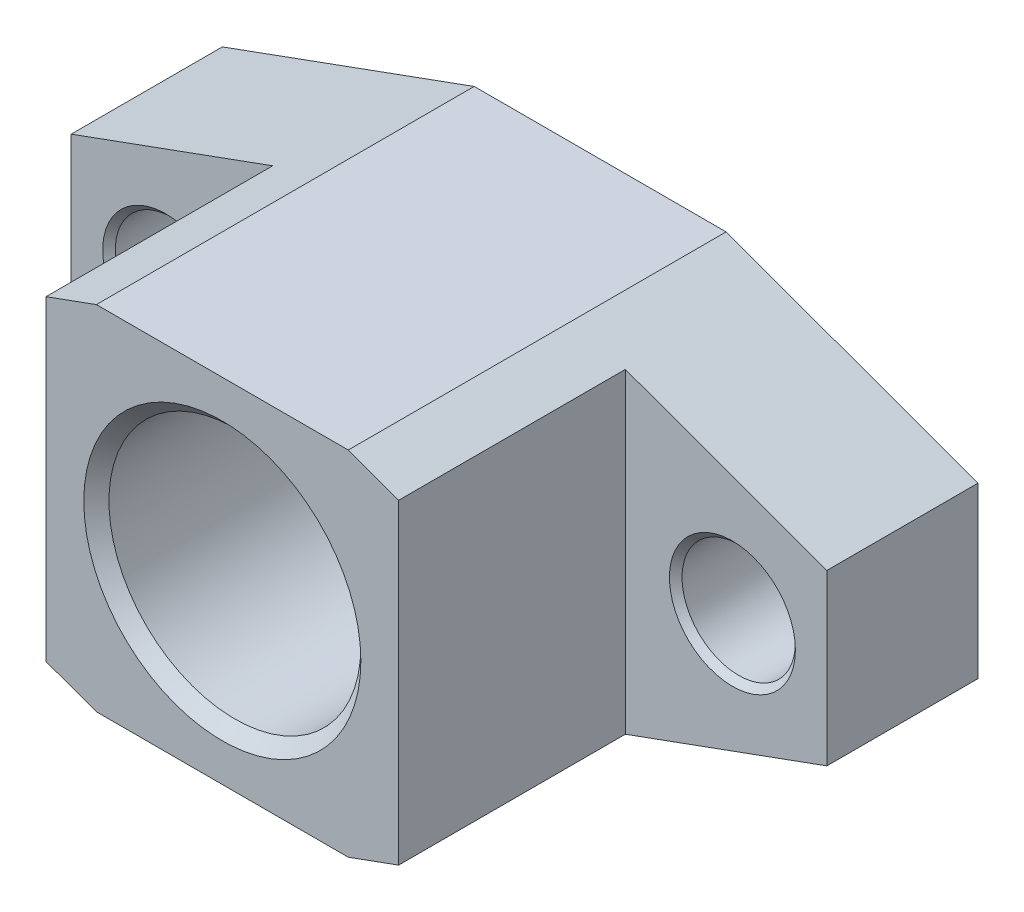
ISO-10303-21;
HEADER;
FILE_DESCRIPTION(('STEP AP214'),'2;1');
FILE_NAME('part.step','',(''),(''),'','','');
FILE_SCHEMA(('AUTOMOTIVE_DESIGN { 1 0 10303 214 1 1 1 1 }'));
ENDSEC;
DATA;
#1=APPLICATION_CONTEXT('core data for automotive mechanical design processes');
#2=APPLICATION_PROTOCOL_DEFINITION('international standard','automotive_design',2000,#1);
#3=PRODUCT_CONTEXT('',#1,'mechanical');
#4=PRODUCT('Part','Part','',(#3));
#5=PRODUCT_RELATED_PRODUCT_CATEGORY('part','',(#4));
#6=PRODUCT_DEFINITION_FORMATION('','',#4);
#7=PRODUCT_DEFINITION_CONTEXT('part definition',#1,'design');
#8=PRODUCT_DEFINITION('design','',#6,#7);
#9=PRODUCT_DEFINITION_SHAPE('','',#8);
#10=(LENGTH_UNIT() NAMED_UNIT(*) SI_UNIT(.MILLI.,.METRE.));
#11=(NAMED_UNIT(*) PLANE_ANGLE_UNIT() SI_UNIT($,.RADIAN.));
#12=(NAMED_UNIT(*) SI_UNIT($,.STERADIAN.) SOLID_ANGLE_UNIT());
#13=UNCERTAINTY_MEASURE_WITH_UNIT(LENGTH_MEASURE(1.E-05),#10,'distance_accuracy_value','');
#14=(GEOMETRIC_REPRESENTATION_CONTEXT(3) GLOBAL_UNCERTAINTY_ASSIGNED_CONTEXT((#13)) GLOBAL_UNIT_ASSIGNED_CONTEXT((#10,
#11,#12)) REPRESENTATION_CONTEXT('',''));
#15=CARTESIAN_POINT('',(0.,0.,0.));
#16=DIRECTION('',(0.,0.,1.));
#17=DIRECTION('',(1.,0.,0.));
#18=AXIS2_PLACEMENT_3D('',#15,#16,#17);
#19=CARTESIAN_POINT('',(-30.,6.72059531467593,12.));
#20=DIRECTION('',(0.,0.,1.));
#21=DIRECTION('',(1.,0.,0.));
#22=AXIS2_PLACEMENT_3D('',#19,#20,#21);
#23=PLANE('',#22);
#24=CARTESIAN_POINT('',(22.5,0.,12.));
#25=DIRECTION('',(0.,0.,1.));
#26=DIRECTION('',(1.,0.,0.));
#27=AXIS2_PLACEMENT_3D('',#24,#25,#26);
#28=CIRCLE('',#27,5.);
#29=CARTESIAN_POINT('',(27.5,0.,12.));
#30=VERTEX_POINT('',#29);
#31=EDGE_CURVE('E486',#30,#30,#28,.T.);
#32=ORIENTED_EDGE('',*,*,#31,.F.);
#33=EDGE_LOOP('',(#32));
#34=FACE_BOUND('',#33,.T.);
#35=DIRECTION('',(0.,1.,0.));
#36=VECTOR('',#35,1.);
#37=CARTESIAN_POINT('',(14.,12.5441190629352,12.));
#38=LINE('',#37,#36);
#39=CARTESIAN_POINT('',(14.,-12.5441190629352,12.));
#40=VERTEX_POINT('',#39);
#41=CARTESIAN_POINT('',(14.,12.5441190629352,12.));
#42=VERTEX_POINT('',#41);
#43=EDGE_CURVE('E35',#40,#42,#38,.T.);
#44=ORIENTED_EDGE('',*,*,#43,.F.);
#45=DIRECTION('',(0.939692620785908,0.342020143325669,0.));
#46=VECTOR('',#45,1.);
#47=CARTESIAN_POINT('',(10.,-14.,12.));
#48=LINE('',#47,#46);
#49=CARTESIAN_POINT('',(30.,-6.72059531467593,12.));
#50=VERTEX_POINT('',#49);
#51=EDGE_CURVE('E161',#40,#50,#48,.T.);
#52=ORIENTED_EDGE('',*,*,#51,.T.);
#53=DIRECTION('',(0.,1.,0.));
#54=VECTOR('',#53,1.);
#55=CARTESIAN_POINT('',(30.,6.72059531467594,12.));
#56=LINE('',#55,#54);
#57=CARTESIAN_POINT('',(30.,6.72059531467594,12.));
#58=VERTEX_POINT('',#57);
#59=EDGE_CURVE('E167',#50,#58,#56,.T.);
#60=ORIENTED_EDGE('',*,*,#59,.T.);
#61=DIRECTION('',(-0.939692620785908,0.342020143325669,0.));
#62=VECTOR('',#61,1.);
#63=CARTESIAN_POINT('',(10.,14.,12.));
#64=LINE('',#63,#62);
#65=EDGE_CURVE('E31',#58,#42,#64,.T.);
#66=ORIENTED_EDGE('',*,*,#65,.T.);
#67=EDGE_LOOP('',(#44,#52,#60,#66));
#68=FACE_BOUND('',#67,.T.);
#69=ADVANCED_FACE('F14',(#34,#68),#23,.T.);
#70=CARTESIAN_POINT('',(-10.,14.,12.));
#71=DIRECTION('',(0.342020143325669,-0.939692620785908,0.));
#72=DIRECTION('',(0.939692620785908,0.342020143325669,0.));
#73=AXIS2_PLACEMENT_3D('',#70,#71,#72);
#74=PLANE('',#73);
#75=DIRECTION('',(-0.939692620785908,-0.342020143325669,0.));
#76=VECTOR('',#75,1.);
#77=CARTESIAN_POINT('',(-10.,14.,0.));
#78=LINE('',#77,#76);
#79=CARTESIAN_POINT('',(-10.,14.,0.));
#80=VERTEX_POINT('',#79);
#81=CARTESIAN_POINT('',(-30.,6.72059531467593,0.));
#82=VERTEX_POINT('',#81);
#83=EDGE_CURVE('E130',#80,#82,#78,.T.);
#84=ORIENTED_EDGE('',*,*,#83,.T.);
#85=DIRECTION('',(0.,0.,-1.));
#86=VECTOR('',#85,1.);
#87=CARTESIAN_POINT('',(-30.,6.72059531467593,12.));
#88=LINE('',#87,#86);
#89=CARTESIAN_POINT('',(-30.,6.72059531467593,12.));
#90=VERTEX_POINT('',#89);
#91=EDGE_CURVE('E9',#90,#82,#88,.T.);
#92=ORIENTED_EDGE('',*,*,#91,.F.);
#93=DIRECTION('',(-0.939692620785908,-0.342020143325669,0.));
#94=VECTOR('',#93,1.);
#95=CARTESIAN_POINT('',(-10.,14.,12.));
#96=LINE('',#95,#94);
#97=CARTESIAN_POINT('',(-14.,12.5441190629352,12.));
#98=VERTEX_POINT('',#97);
#99=EDGE_CURVE('E129',#98,#90,#96,.T.);
#100=ORIENTED_EDGE('',*,*,#99,.F.);
#101=DIRECTION('',(0.,0.,-1.));
#102=VECTOR('',#101,1.);
#103=CARTESIAN_POINT('',(-14.,12.5441190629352,30.));
#104=LINE('',#103,#102);
#105=CARTESIAN_POINT('',(-14.,12.5441190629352,30.));
#106=VERTEX_POINT('',#105);
#107=EDGE_CURVE('E108',#106,#98,#104,.T.);
#108=ORIENTED_EDGE('',*,*,#107,.F.);
#109=DIRECTION('',(-0.939692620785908,-0.342020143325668,0.));
#110=VECTOR('',#109,1.);
#111=CARTESIAN_POINT('',(-10.,14.,30.));
#112=LINE('',#111,#110);
#113=CARTESIAN_POINT('',(-10.,14.,30.));
#114=VERTEX_POINT('',#113);
#115=EDGE_CURVE('E115',#114,#106,#112,.T.);
#116=ORIENTED_EDGE('',*,*,#115,.F.);
#117=DIRECTION('',(0.,0.,-1.));
#118=VECTOR('',#117,1.);
#119=CARTESIAN_POINT('',(-10.,14.,12.));
#120=LINE('',#119,#118);
#121=EDGE_CURVE('E172',#114,#80,#120,.T.);
#122=ORIENTED_EDGE('',*,*,#121,.T.);
#123=EDGE_LOOP('',(#84,#92,#100,#108,#116,#122));
#124=FACE_BOUND('',#123,.T.);
#125=ADVANCED_FACE('F16',(#124),#74,.F.);
#126=CARTESIAN_POINT('',(-30.,6.72059531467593,12.));
#127=DIRECTION('',(1.,0.,0.));
#128=DIRECTION('',(0.,0.,-1.));
#129=AXIS2_PLACEMENT_3D('',#126,#127,#128);
#130=PLANE('',#129);
#131=DIRECTION('',(0.,-1.,0.));
#132=VECTOR('',#131,1.);
#133=CARTESIAN_POINT('',(-30.,6.72059531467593,0.));
#134=LINE('',#133,#132);
#135=CARTESIAN_POINT('',(-30.,-6.72059531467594,0.));
#136=VERTEX_POINT('',#135);
#137=EDGE_CURVE('E132',#82,#136,#134,.T.);
#138=ORIENTED_EDGE('',*,*,#137,.T.);
#139=DIRECTION('',(0.,0.,-1.));
#140=VECTOR('',#139,1.);
#141=CARTESIAN_POINT('',(-30.,-6.72059531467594,12.));
#142=LINE('',#141,#140);
#143=CARTESIAN_POINT('',(-30.,-6.72059531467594,12.));
#144=VERTEX_POINT('',#143);
#145=EDGE_CURVE('E23',#144,#136,#142,.T.);
#146=ORIENTED_EDGE('',*,*,#145,.F.);
#147=DIRECTION('',(0.,-1.,0.));
#148=VECTOR('',#147,1.);
#149=CARTESIAN_POINT('',(-30.,6.72059531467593,12.));
#150=LINE('',#149,#148);
#151=EDGE_CURVE('E153',#90,#144,#150,.T.);
#152=ORIENTED_EDGE('',*,*,#151,.F.);
#153=ORIENTED_EDGE('',*,*,#91,.T.);
#154=EDGE_LOOP('',(#138,#146,#152,#153));
#155=FACE_BOUND('',#154,.T.);
#156=ADVANCED_FACE('F244',(#155),#130,.F.);
#157=CARTESIAN_POINT('',(-10.,-14.,12.));
#158=DIRECTION('',(0.342020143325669,0.939692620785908,0.));
#159=DIRECTION('',(-0.939692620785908,0.342020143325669,0.));
#160=AXIS2_PLACEMENT_3D('',#157,#158,#159);
#161=PLANE('',#160);
#162=DIRECTION('',(0.939692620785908,-0.342020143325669,0.));
#163=VECTOR('',#162,1.);
#164=CARTESIAN_POINT('',(-10.,-14.,0.));
#165=LINE('',#164,#163);
#166=CARTESIAN_POINT('',(-10.,-14.,0.));
#167=VERTEX_POINT('',#166);
#168=EDGE_CURVE('E288',#136,#167,#165,.T.);
#169=ORIENTED_EDGE('',*,*,#168,.T.);
#170=DIRECTION('',(0.,0.,-1.));
#171=VECTOR('',#170,1.);
#172=CARTESIAN_POINT('',(-10.,-14.,12.));
#173=LINE('',#172,#171);
#174=CARTESIAN_POINT('',(-10.,-14.,30.));
#175=VERTEX_POINT('',#174);
#176=EDGE_CURVE('E268',#175,#167,#173,.T.);
#177=ORIENTED_EDGE('',*,*,#176,.F.);
#178=DIRECTION('',(0.939692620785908,-0.34202014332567,0.));
#179=VECTOR('',#178,1.);
#180=CARTESIAN_POINT('',(-14.,-12.5441190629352,30.));
#181=LINE('',#180,#179);
#182=CARTESIAN_POINT('',(-14.,-12.5441190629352,30.));
#183=VERTEX_POINT('',#182);
#184=EDGE_CURVE('E114',#183,#175,#181,.T.);
#185=ORIENTED_EDGE('',*,*,#184,.F.);
#186=DIRECTION('',(0.,0.,-1.));
#187=VECTOR('',#186,1.);
#188=CARTESIAN_POINT('',(-14.,-12.5441190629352,30.));
#189=LINE('',#188,#187);
#190=CARTESIAN_POINT('',(-14.,-12.5441190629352,12.));
#191=VERTEX_POINT('',#190);
#192=EDGE_CURVE('E110',#183,#191,#189,.T.);
#193=ORIENTED_EDGE('',*,*,#192,.T.);
#194=DIRECTION('',(0.939692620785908,-0.342020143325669,0.));
#195=VECTOR('',#194,1.);
#196=CARTESIAN_POINT('',(-10.,-14.,12.));
#197=LINE('',#196,#195);
#198=EDGE_CURVE('E159',#144,#191,#197,.T.);
#199=ORIENTED_EDGE('',*,*,#198,.F.);
#200=ORIENTED_EDGE('',*,*,#145,.T.);
#201=EDGE_LOOP('',(#169,#177,#185,#193,#199,#200));
#202=FACE_BOUND('',#201,.T.);
#203=ADVANCED_FACE('F265',(#202),#161,.F.);
#204=CARTESIAN_POINT('',(10.,-14.,12.));
#205=DIRECTION('',(0.,1.,0.));
#206=DIRECTION('',(-1.,0.,0.));
#207=AXIS2_PLACEMENT_3D('',#204,#205,#206);
#208=PLANE('',#207);
#209=DIRECTION('',(1.,0.,0.));
#210=VECTOR('',#209,1.);
#211=CARTESIAN_POINT('',(10.,-14.,0.));
#212=LINE('',#211,#210);
#213=CARTESIAN_POINT('',(10.,-14.,0.));
#214=VERTEX_POINT('',#213);
#215=EDGE_CURVE('E274',#167,#214,#212,.T.);
#216=ORIENTED_EDGE('',*,*,#215,.T.);
#217=DIRECTION('',(0.,0.,-1.));
#218=VECTOR('',#217,1.);
#219=CARTESIAN_POINT('',(10.,-14.,12.));
#220=LINE('',#219,#218);
#221=CARTESIAN_POINT('',(10.,-14.,30.));
#222=VERTEX_POINT('',#221);
#223=EDGE_CURVE('E273',#222,#214,#220,.T.);
#224=ORIENTED_EDGE('',*,*,#223,.F.);
#225=DIRECTION('',(1.,0.,0.));
#226=VECTOR('',#225,1.);
#227=CARTESIAN_POINT('',(-10.,-14.,30.));
#228=LINE('',#227,#226);
#229=EDGE_CURVE('E185',#175,#222,#228,.T.);
#230=ORIENTED_EDGE('',*,*,#229,.F.);
#231=ORIENTED_EDGE('',*,*,#176,.T.);
#232=EDGE_LOOP('',(#216,#224,#230,#231));
#233=FACE_BOUND('',#232,.T.);
#234=ADVANCED_FACE('F271',(#233),#208,.F.);
#235=CARTESIAN_POINT('',(10.,-14.,12.));
#236=DIRECTION('',(-0.342020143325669,0.939692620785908,0.));
#237=DIRECTION('',(-0.939692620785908,-0.342020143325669,0.));
#238=AXIS2_PLACEMENT_3D('',#235,#236,#237);
#239=PLANE('',#238);
#240=DIRECTION('',(0.939692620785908,0.342020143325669,0.));
#241=VECTOR('',#240,1.);
#242=CARTESIAN_POINT('',(10.,-14.,0.));
#243=LINE('',#242,#241);
#244=CARTESIAN_POINT('',(30.,-6.72059531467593,0.));
#245=VERTEX_POINT('',#244);
#246=EDGE_CURVE('E285',#214,#245,#243,.T.);
#247=ORIENTED_EDGE('',*,*,#246,.T.);
#248=DIRECTION('',(0.,0.,-1.));
#249=VECTOR('',#248,1.);
#250=CARTESIAN_POINT('',(30.,-6.72059531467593,12.));
#251=LINE('',#250,#249);
#252=EDGE_CURVE('E209',#50,#245,#251,.T.);
#253=ORIENTED_EDGE('',*,*,#252,.F.);
#254=ORIENTED_EDGE('',*,*,#51,.F.);
#255=DIRECTION('',(0.,0.,-1.));
#256=VECTOR('',#255,1.);
#257=CARTESIAN_POINT('',(14.,-12.5441190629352,30.));
#258=LINE('',#257,#256);
#259=CARTESIAN_POINT('',(14.,-12.5441190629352,30.));
#260=VERTEX_POINT('',#259);
#261=EDGE_CURVE('E134',#260,#40,#258,.T.);
#262=ORIENTED_EDGE('',*,*,#261,.F.);
#263=DIRECTION('',(0.939692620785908,0.34202014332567,0.));
#264=VECTOR('',#263,1.);
#265=CARTESIAN_POINT('',(10.,-14.,30.));
#266=LINE('',#265,#264);
#267=EDGE_CURVE('E188',#222,#260,#266,.T.);
#268=ORIENTED_EDGE('',*,*,#267,.F.);
#269=ORIENTED_EDGE('',*,*,#223,.T.);
#270=EDGE_LOOP('',(#247,#253,#254,#262,#268,#269));
#271=FACE_BOUND('',#270,.T.);
#272=ADVANCED_FACE('F205',(#271),#239,.F.);
#273=CARTESIAN_POINT('',(30.,6.72059531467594,12.));
#274=DIRECTION('',(-1.,0.,0.));
#275=DIRECTION('',(0.,0.,1.));
#276=AXIS2_PLACEMENT_3D('',#273,#274,#275);
#277=PLANE('',#276);
#278=DIRECTION('',(0.,1.,0.));
#279=VECTOR('',#278,1.);
#280=CARTESIAN_POINT('',(30.,6.72059531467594,0.));
#281=LINE('',#280,#279);
#282=CARTESIAN_POINT('',(30.,6.72059531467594,0.));
#283=VERTEX_POINT('',#282);
#284=EDGE_CURVE('E217',#245,#283,#281,.T.);
#285=ORIENTED_EDGE('',*,*,#284,.T.);
#286=DIRECTION('',(0.,0.,-1.));
#287=VECTOR('',#286,1.);
#288=CARTESIAN_POINT('',(30.,6.72059531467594,12.));
#289=LINE('',#288,#287);
#290=EDGE_CURVE('E214',#58,#283,#289,.T.);
#291=ORIENTED_EDGE('',*,*,#290,.F.);
#292=ORIENTED_EDGE('',*,*,#59,.F.);
#293=ORIENTED_EDGE('',*,*,#252,.T.);
#294=EDGE_LOOP('',(#285,#291,#292,#293));
#295=FACE_BOUND('',#294,.T.);
#296=ADVANCED_FACE('F215',(#295),#277,.F.);
#297=CARTESIAN_POINT('',(10.,14.,12.));
#298=DIRECTION('',(-0.342020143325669,-0.939692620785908,0.));
#299=DIRECTION('',(0.939692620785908,-0.342020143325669,0.));
#300=AXIS2_PLACEMENT_3D('',#297,#298,#299);
#301=PLANE('',#300);
#302=DIRECTION('',(-0.939692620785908,0.342020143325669,0.));
#303=VECTOR('',#302,1.);
#304=CARTESIAN_POINT('',(10.,14.,0.));
#305=LINE('',#304,#303);
#306=CARTESIAN_POINT('',(10.,14.,0.));
#307=VERTEX_POINT('',#306);
#308=EDGE_CURVE('E222',#283,#307,#305,.T.);
#309=ORIENTED_EDGE('',*,*,#308,.T.);
#310=DIRECTION('',(0.,0.,-1.));
#311=VECTOR('',#310,1.);
#312=CARTESIAN_POINT('',(10.,14.,12.));
#313=LINE('',#312,#311);
#314=CARTESIAN_POINT('',(10.,14.,30.));
#315=VERTEX_POINT('',#314);
#316=EDGE_CURVE('E219',#315,#307,#313,.T.);
#317=ORIENTED_EDGE('',*,*,#316,.F.);
#318=DIRECTION('',(-0.939692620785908,0.34202014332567,0.));
#319=VECTOR('',#318,1.);
#320=CARTESIAN_POINT('',(14.,12.5441190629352,30.));
#321=LINE('',#320,#319);
#322=CARTESIAN_POINT('',(14.,12.5441190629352,30.));
#323=VERTEX_POINT('',#322);
#324=EDGE_CURVE('E192',#323,#315,#321,.T.);
#325=ORIENTED_EDGE('',*,*,#324,.F.);
#326=DIRECTION('',(0.,0.,-1.));
#327=VECTOR('',#326,1.);
#328=CARTESIAN_POINT('',(14.,12.5441190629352,30.));
#329=LINE('',#328,#327);
#330=EDGE_CURVE('E144',#323,#42,#329,.T.);
#331=ORIENTED_EDGE('',*,*,#330,.T.);
#332=ORIENTED_EDGE('',*,*,#65,.F.);
#333=ORIENTED_EDGE('',*,*,#290,.T.);
#334=EDGE_LOOP('',(#309,#317,#325,#331,#332,#333));
#335=FACE_BOUND('',#334,.T.);
#336=ADVANCED_FACE('F221',(#335),#301,.F.);
#337=CARTESIAN_POINT('',(10.,14.,12.));
#338=DIRECTION('',(0.,-1.,0.));
#339=DIRECTION('',(1.,0.,0.));
#340=AXIS2_PLACEMENT_3D('',#337,#338,#339);
#341=PLANE('',#340);
#342=DIRECTION('',(-1.,0.,0.));
#343=VECTOR('',#342,1.);
#344=CARTESIAN_POINT('',(10.,14.,0.));
#345=LINE('',#344,#343);
#346=EDGE_CURVE('E157',#307,#80,#345,.T.);
#347=ORIENTED_EDGE('',*,*,#346,.T.);
#348=ORIENTED_EDGE('',*,*,#121,.F.);
#349=DIRECTION('',(-1.,0.,0.));
#350=VECTOR('',#349,1.);
#351=CARTESIAN_POINT('',(10.,14.,30.));
#352=LINE('',#351,#350);
#353=EDGE_CURVE('E122',#315,#114,#352,.T.);
#354=ORIENTED_EDGE('',*,*,#353,.F.);
#355=ORIENTED_EDGE('',*,*,#316,.T.);
#356=EDGE_LOOP('',(#347,#348,#354,#355));
#357=FACE_BOUND('',#356,.T.);
#358=ADVANCED_FACE('F225',(#357),#341,.F.);
#359=CARTESIAN_POINT('',(-22.5,0.,12.));
#360=DIRECTION('',(0.,0.,1.));
#361=DIRECTION('',(1.,0.,0.));
#362=AXIS2_PLACEMENT_3D('',#359,#360,#361);
#363=CIRCLE('',#362,5.);
#364=CARTESIAN_POINT('',(-17.5,0.,12.));
#365=VERTEX_POINT('',#364);
#366=EDGE_CURVE('E259',#365,#365,#363,.T.);
#367=ORIENTED_EDGE('',*,*,#366,.F.);
#368=EDGE_LOOP('',(#367));
#369=FACE_BOUND('',#368,.T.);
#370=DIRECTION('',(0.,-1.,0.));
#371=VECTOR('',#370,1.);
#372=CARTESIAN_POINT('',(-14.,12.5441190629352,12.));
#373=LINE('',#372,#371);
#374=EDGE_CURVE('E143',#98,#191,#373,.T.);
#375=ORIENTED_EDGE('',*,*,#374,.F.);
#376=ORIENTED_EDGE('',*,*,#99,.T.);
#377=ORIENTED_EDGE('',*,*,#151,.T.);
#378=ORIENTED_EDGE('',*,*,#198,.T.);
#379=EDGE_LOOP('',(#375,#376,#377,#378));
#380=FACE_BOUND('',#379,.T.);
#381=ADVANCED_FACE('F233',(#369,#380),#23,.T.);
#382=CARTESIAN_POINT('',(-30.,6.72059531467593,0.));
#383=DIRECTION('',(0.,0.,1.));
#384=DIRECTION('',(1.,0.,0.));
#385=AXIS2_PLACEMENT_3D('',#382,#383,#384);
#386=PLANE('',#385);
#387=CARTESIAN_POINT('',(-22.5,0.,0.));
#388=DIRECTION('',(0.,0.,1.));
#389=DIRECTION('',(1.,0.,0.));
#390=AXIS2_PLACEMENT_3D('',#387,#388,#389);
#391=CIRCLE('',#390,5.);
#392=CARTESIAN_POINT('',(-17.5,0.,0.));
#393=VERTEX_POINT('',#392);
#394=EDGE_CURVE('E483',#393,#393,#391,.T.);
#395=ORIENTED_EDGE('',*,*,#394,.T.);
#396=EDGE_LOOP('',(#395));
#397=FACE_BOUND('',#396,.T.);
#398=CARTESIAN_POINT('',(22.5,0.,0.));
#399=DIRECTION('',(0.,0.,1.));
#400=DIRECTION('',(1.,0.,0.));
#401=AXIS2_PLACEMENT_3D('',#398,#399,#400);
#402=CIRCLE('',#401,5.);
#403=CARTESIAN_POINT('',(27.5,0.,0.));
#404=VERTEX_POINT('',#403);
#405=EDGE_CURVE('E495',#404,#404,#402,.T.);
#406=ORIENTED_EDGE('',*,*,#405,.T.);
#407=EDGE_LOOP('',(#406));
#408=FACE_BOUND('',#407,.T.);
#409=CARTESIAN_POINT('',(0.,0.,0.));
#410=DIRECTION('',(0.,0.,1.));
#411=DIRECTION('',(1.,0.,0.));
#412=AXIS2_PLACEMENT_3D('',#409,#410,#411);
#413=CIRCLE('',#412,11.);
#414=CARTESIAN_POINT('',(11.,0.,0.));
#415=VERTEX_POINT('',#414);
#416=EDGE_CURVE('E173',#415,#415,#413,.T.);
#417=ORIENTED_EDGE('',*,*,#416,.T.);
#418=EDGE_LOOP('',(#417));
#419=FACE_BOUND('',#418,.T.);
#420=ORIENTED_EDGE('',*,*,#83,.F.);
#421=ORIENTED_EDGE('',*,*,#346,.F.);
#422=ORIENTED_EDGE('',*,*,#308,.F.);
#423=ORIENTED_EDGE('',*,*,#284,.F.);
#424=ORIENTED_EDGE('',*,*,#246,.F.);
#425=ORIENTED_EDGE('',*,*,#215,.F.);
#426=ORIENTED_EDGE('',*,*,#168,.F.);
#427=ORIENTED_EDGE('',*,*,#137,.F.);
#428=EDGE_LOOP('',(#420,#421,#422,#423,#424,#425,#426,#427));
#429=FACE_BOUND('',#428,.T.);
#430=ADVANCED_FACE('F249',(#397,#408,#419,#429),#386,.F.);
#431=CARTESIAN_POINT('',(-14.,12.5441190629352,30.));
#432=DIRECTION('',(1.,0.,0.));
#433=DIRECTION('',(0.,1.,0.));
#434=AXIS2_PLACEMENT_3D('',#431,#432,#433);
#435=PLANE('',#434);
#436=ORIENTED_EDGE('',*,*,#374,.T.);
#437=ORIENTED_EDGE('',*,*,#192,.F.);
#438=DIRECTION('',(0.,-1.,0.));
#439=VECTOR('',#438,1.);
#440=CARTESIAN_POINT('',(-14.,12.5441190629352,30.));
#441=LINE('',#440,#439);
#442=EDGE_CURVE('E103',#106,#183,#441,.T.);
#443=ORIENTED_EDGE('',*,*,#442,.F.);
#444=ORIENTED_EDGE('',*,*,#107,.T.);
#445=EDGE_LOOP('',(#436,#437,#443,#444));
#446=FACE_BOUND('',#445,.T.);
#447=ADVANCED_FACE('F106',(#446),#435,.F.);
#448=CARTESIAN_POINT('',(14.,12.5441190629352,30.));
#449=DIRECTION('',(-1.,0.,0.));
#450=DIRECTION('',(0.,-1.,0.));
#451=AXIS2_PLACEMENT_3D('',#448,#449,#450);
#452=PLANE('',#451);
#453=ORIENTED_EDGE('',*,*,#43,.T.);
#454=ORIENTED_EDGE('',*,*,#330,.F.);
#455=DIRECTION('',(0.,1.,0.));
#456=VECTOR('',#455,1.);
#457=CARTESIAN_POINT('',(14.,12.5441190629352,30.));
#458=LINE('',#457,#456);
#459=EDGE_CURVE('E190',#260,#323,#458,.T.);
#460=ORIENTED_EDGE('',*,*,#459,.F.);
#461=ORIENTED_EDGE('',*,*,#261,.T.);
#462=EDGE_LOOP('',(#453,#454,#460,#461));
#463=FACE_BOUND('',#462,.T.);
#464=ADVANCED_FACE('F202',(#463),#452,.F.);
#465=CARTESIAN_POINT('',(-14.,12.5441190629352,30.));
#466=DIRECTION('',(0.,0.,1.));
#467=DIRECTION('',(1.,0.,0.));
#468=AXIS2_PLACEMENT_3D('',#465,#466,#467);
#469=PLANE('',#468);
#470=CARTESIAN_POINT('',(0.,0.,30.));
#471=DIRECTION('',(0.,0.,1.));
#472=DIRECTION('',(1.,0.,0.));
#473=AXIS2_PLACEMENT_3D('',#470,#471,#472);
#474=CIRCLE('',#473,11.);
#475=CARTESIAN_POINT('',(11.,0.,30.));
#476=VERTEX_POINT('',#475);
#477=EDGE_CURVE('E498',#476,#476,#474,.T.);
#478=ORIENTED_EDGE('',*,*,#477,.F.);
#479=EDGE_LOOP('',(#478));
#480=FACE_BOUND('',#479,.T.);
#481=ORIENTED_EDGE('',*,*,#115,.T.);
#482=ORIENTED_EDGE('',*,*,#442,.T.);
#483=ORIENTED_EDGE('',*,*,#184,.T.);
#484=ORIENTED_EDGE('',*,*,#229,.T.);
#485=ORIENTED_EDGE('',*,*,#267,.T.);
#486=ORIENTED_EDGE('',*,*,#459,.T.);
#487=ORIENTED_EDGE('',*,*,#324,.T.);
#488=ORIENTED_EDGE('',*,*,#353,.T.);
#489=EDGE_LOOP('',(#481,#482,#483,#484,#485,#486,#487,#488));
#490=FACE_BOUND('',#489,.T.);
#491=ADVANCED_FACE('F119',(#480,#490),#469,.T.);
#492=CARTESIAN_POINT('',(0.,0.,1.));
#493=DIRECTION('',(0.,0.,-1.));
#494=DIRECTION('',(-1.,0.,0.));
#495=AXIS2_PLACEMENT_3D('',#492,#493,#494);
#496=CONICAL_SURFACE('',#495,10.,0.78539816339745);
#497=ORIENTED_EDGE('',*,*,#416,.F.);
#498=EDGE_LOOP('',(#497));
#499=FACE_BOUND('',#498,.T.);
#500=CARTESIAN_POINT('',(0.,0.,1.));
#501=DIRECTION('',(0.,0.,1.));
#502=DIRECTION('',(1.,0.,0.));
#503=AXIS2_PLACEMENT_3D('',#500,#501,#502);
#504=CIRCLE('',#503,10.);
#505=CARTESIAN_POINT('',(10.,0.,1.));
#506=VERTEX_POINT('',#505);
#507=EDGE_CURVE('E175',#506,#506,#504,.T.);
#508=ORIENTED_EDGE('',*,*,#507,.T.);
#509=EDGE_LOOP('',(#508));
#510=FACE_BOUND('',#509,.T.);
#511=ADVANCED_FACE('F377',(#499,#510),#496,.F.);
#512=CARTESIAN_POINT('',(0.,0.,30.));
#513=DIRECTION('',(0.,0.,1.));
#514=DIRECTION('',(1.,0.,0.));
#515=AXIS2_PLACEMENT_3D('',#512,#513,#514);
#516=CYLINDRICAL_SURFACE('',#515,10.);
#517=ORIENTED_EDGE('',*,*,#507,.F.);
#518=EDGE_LOOP('',(#517));
#519=FACE_BOUND('',#518,.T.);
#520=CARTESIAN_POINT('',(0.,0.,29.));
#521=DIRECTION('',(0.,0.,1.));
#522=DIRECTION('',(1.,0.,0.));
#523=AXIS2_PLACEMENT_3D('',#520,#521,#522);
#524=CIRCLE('',#523,10.);
#525=CARTESIAN_POINT('',(10.,0.,29.));
#526=VERTEX_POINT('',#525);
#527=EDGE_CURVE('E180',#526,#526,#524,.T.);
#528=ORIENTED_EDGE('',*,*,#527,.T.);
#529=EDGE_LOOP('',(#528));
#530=FACE_BOUND('',#529,.T.);
#531=ADVANCED_FACE('F386',(#519,#530),#516,.F.);
#532=CARTESIAN_POINT('',(0.,0.,30.));
#533=DIRECTION('',(0.,0.,1.));
#534=DIRECTION('',(1.,0.,0.));
#535=AXIS2_PLACEMENT_3D('',#532,#533,#534);
#536=CONICAL_SURFACE('',#535,11.,0.785398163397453);
#537=ORIENTED_EDGE('',*,*,#527,.F.);
#538=EDGE_LOOP('',(#537));
#539=FACE_BOUND('',#538,.T.);
#540=ORIENTED_EDGE('',*,*,#477,.T.);
#541=EDGE_LOOP('',(#540));
#542=FACE_BOUND('',#541,.T.);
#543=ADVANCED_FACE('F395',(#539,#542),#536,.F.);
#544=CARTESIAN_POINT('',(22.5,0.,0.5));
#545=DIRECTION('',(0.,0.,-1.));
#546=DIRECTION('',(-1.,0.,0.));
#547=AXIS2_PLACEMENT_3D('',#544,#545,#546);
#548=CONICAL_SURFACE('',#547,4.5,0.78539816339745);
#549=ORIENTED_EDGE('',*,*,#405,.F.);
#550=EDGE_LOOP('',(#549));
#551=FACE_BOUND('',#550,.T.);
#552=CARTESIAN_POINT('',(22.5,0.,0.5));
#553=DIRECTION('',(0.,0.,1.));
#554=DIRECTION('',(1.,0.,0.));
#555=AXIS2_PLACEMENT_3D('',#552,#553,#554);
#556=CIRCLE('',#555,4.5);
#557=CARTESIAN_POINT('',(27.,0.,0.5));
#558=VERTEX_POINT('',#557);
#559=EDGE_CURVE('E492',#558,#558,#556,.T.);
#560=ORIENTED_EDGE('',*,*,#559,.T.);
#561=EDGE_LOOP('',(#560));
#562=FACE_BOUND('',#561,.T.);
#563=ADVANCED_FACE('F404',(#551,#562),#548,.F.);
#564=CARTESIAN_POINT('',(22.5,0.,12.));
#565=DIRECTION('',(0.,0.,1.));
#566=DIRECTION('',(1.,0.,0.));
#567=AXIS2_PLACEMENT_3D('',#564,#565,#566);
#568=CYLINDRICAL_SURFACE('',#567,4.5);
#569=ORIENTED_EDGE('',*,*,#559,.F.);
#570=EDGE_LOOP('',(#569));
#571=FACE_BOUND('',#570,.T.);
#572=CARTESIAN_POINT('',(22.5,0.,11.5));
#573=DIRECTION('',(0.,0.,1.));
#574=DIRECTION('',(1.,0.,0.));
#575=AXIS2_PLACEMENT_3D('',#572,#573,#574);
#576=CIRCLE('',#575,4.5);
#577=CARTESIAN_POINT('',(27.,0.,11.5));
#578=VERTEX_POINT('',#577);
#579=EDGE_CURVE('E489',#578,#578,#576,.T.);
#580=ORIENTED_EDGE('',*,*,#579,.T.);
#581=EDGE_LOOP('',(#580));
#582=FACE_BOUND('',#581,.T.);
#583=ADVANCED_FACE('F413',(#571,#582),#568,.F.);
#584=CARTESIAN_POINT('',(22.5,0.,12.));
#585=DIRECTION('',(0.,0.,1.));
#586=DIRECTION('',(1.,0.,0.));
#587=AXIS2_PLACEMENT_3D('',#584,#585,#586);
#588=CONICAL_SURFACE('',#587,5.,0.785398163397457);
#589=ORIENTED_EDGE('',*,*,#579,.F.);
#590=EDGE_LOOP('',(#589));
#591=FACE_BOUND('',#590,.T.);
#592=ORIENTED_EDGE('',*,*,#31,.T.);
#593=EDGE_LOOP('',(#592));
#594=FACE_BOUND('',#593,.T.);
#595=ADVANCED_FACE('F422',(#591,#594),#588,.F.);
#596=CARTESIAN_POINT('',(-22.5,0.,0.5));
#597=DIRECTION('',(0.,0.,-1.));
#598=DIRECTION('',(-1.,0.,0.));
#599=AXIS2_PLACEMENT_3D('',#596,#597,#598);
#600=CONICAL_SURFACE('',#599,4.5,0.78539816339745);
#601=ORIENTED_EDGE('',*,*,#394,.F.);
#602=EDGE_LOOP('',(#601));
#603=FACE_BOUND('',#602,.T.);
#604=CARTESIAN_POINT('',(-22.5,0.,0.5));
#605=DIRECTION('',(0.,0.,1.));
#606=DIRECTION('',(1.,0.,0.));
#607=AXIS2_PLACEMENT_3D('',#604,#605,#606);
#608=CIRCLE('',#607,4.5);
#609=CARTESIAN_POINT('',(-18.,0.,0.5));
#610=VERTEX_POINT('',#609);
#611=EDGE_CURVE('E478',#610,#610,#608,.T.);
#612=ORIENTED_EDGE('',*,*,#611,.T.);
#613=EDGE_LOOP('',(#612));
#614=FACE_BOUND('',#613,.T.);
#615=ADVANCED_FACE('F431',(#603,#614),#600,.F.);
#616=CARTESIAN_POINT('',(-22.5,0.,12.));
#617=DIRECTION('',(0.,0.,1.));
#618=DIRECTION('',(1.,0.,0.));
#619=AXIS2_PLACEMENT_3D('',#616,#617,#618);
#620=CYLINDRICAL_SURFACE('',#619,4.5);
#621=ORIENTED_EDGE('',*,*,#611,.F.);
#622=EDGE_LOOP('',(#621));
#623=FACE_BOUND('',#622,.T.);
#624=CARTESIAN_POINT('',(-22.5,0.,11.5));
#625=DIRECTION('',(0.,0.,1.));
#626=DIRECTION('',(1.,0.,0.));
#627=AXIS2_PLACEMENT_3D('',#624,#625,#626);
#628=CIRCLE('',#627,4.5);
#629=CARTESIAN_POINT('',(-18.,0.,11.5));
#630=VERTEX_POINT('',#629);
#631=EDGE_CURVE('E476',#630,#630,#628,.T.);
#632=ORIENTED_EDGE('',*,*,#631,.T.);
#633=EDGE_LOOP('',(#632));
#634=FACE_BOUND('',#633,.T.);
#635=ADVANCED_FACE('F440',(#623,#634),#620,.F.);
#636=CARTESIAN_POINT('',(-22.5,0.,12.));
#637=DIRECTION('',(0.,0.,1.));
#638=DIRECTION('',(1.,0.,0.));
#639=AXIS2_PLACEMENT_3D('',#636,#637,#638);
#640=CONICAL_SURFACE('',#639,5.,0.785398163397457);
#641=ORIENTED_EDGE('',*,*,#631,.F.);
#642=EDGE_LOOP('',(#641));
#643=FACE_BOUND('',#642,.T.);
#644=ORIENTED_EDGE('',*,*,#366,.T.);
#645=EDGE_LOOP('',(#644));
#646=FACE_BOUND('',#645,.T.);
#647=ADVANCED_FACE('F449',(#643,#646),#640,.F.);
#648=CLOSED_SHELL('',(#69,#125,#156,#203,#234,#272,#296,#336,#358,#381,#430,#447,#464,#491,#511,
#531,#543,#563,#583,#595,#615,#635,#647));
#649=MANIFOLD_SOLID_BREP('B1',#648);
#650=ADVANCED_BREP_SHAPE_REPRESENTATION('',(#18,#649),#14);
#651=SHAPE_DEFINITION_REPRESENTATION(#9,#650);
ENDSEC;
END-ISO-10303-21;
